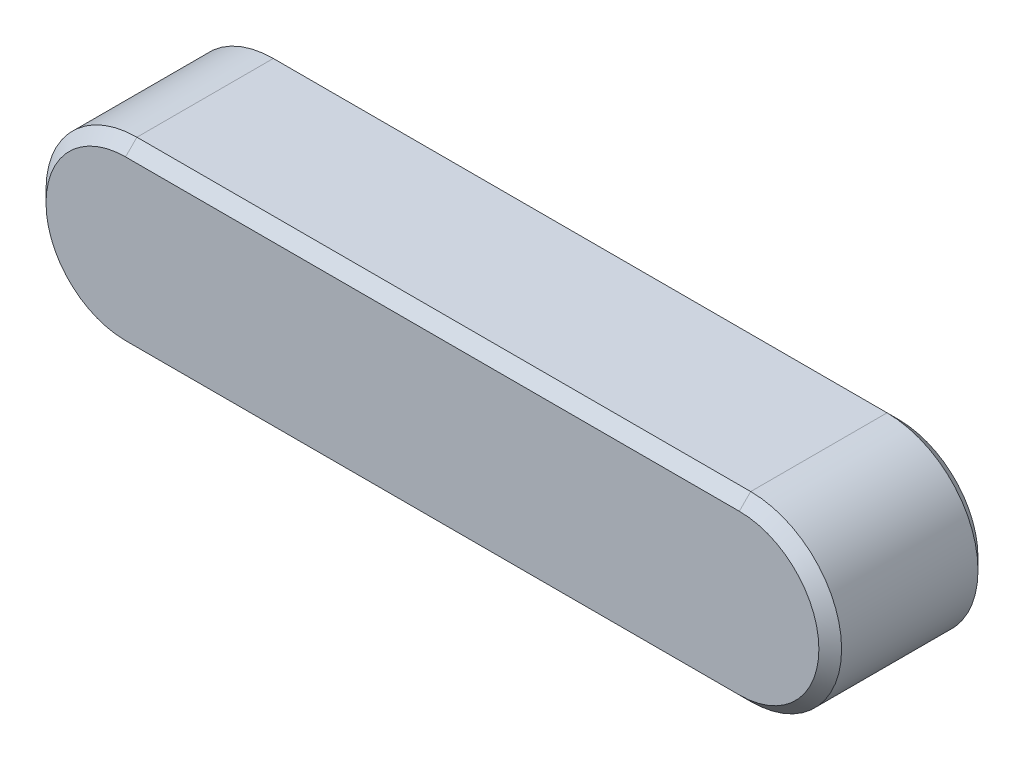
ISO-10303-21;
HEADER;
FILE_DESCRIPTION(('STEP AP214'),'2;1');
FILE_NAME('part.step','',(''),(''),'','','');
FILE_SCHEMA(('AUTOMOTIVE_DESIGN { 1 0 10303 214 1 1 1 1 }'));
ENDSEC;
DATA;
#1=APPLICATION_CONTEXT('core data for automotive mechanical design processes');
#2=APPLICATION_PROTOCOL_DEFINITION('international standard','automotive_design',2000,#1);
#3=PRODUCT_CONTEXT('',#1,'mechanical');
#4=PRODUCT('Part','Part','',(#3));
#5=PRODUCT_RELATED_PRODUCT_CATEGORY('part','',(#4));
#6=PRODUCT_DEFINITION_FORMATION('','',#4);
#7=PRODUCT_DEFINITION_CONTEXT('part definition',#1,'design');
#8=PRODUCT_DEFINITION('design','',#6,#7);
#9=PRODUCT_DEFINITION_SHAPE('','',#8);
#10=(LENGTH_UNIT() NAMED_UNIT(*) SI_UNIT(.MILLI.,.METRE.));
#11=(NAMED_UNIT(*) PLANE_ANGLE_UNIT() SI_UNIT($,.RADIAN.));
#12=(NAMED_UNIT(*) SI_UNIT($,.STERADIAN.) SOLID_ANGLE_UNIT());
#13=UNCERTAINTY_MEASURE_WITH_UNIT(LENGTH_MEASURE(1.E-05),#10,'distance_accuracy_value','');
#14=(GEOMETRIC_REPRESENTATION_CONTEXT(3) GLOBAL_UNCERTAINTY_ASSIGNED_CONTEXT((#13)) GLOBAL_UNIT_ASSIGNED_CONTEXT((#10,
#11,#12)) REPRESENTATION_CONTEXT('',''));
#15=CARTESIAN_POINT('',(0.,0.,0.));
#16=DIRECTION('',(0.,0.,1.));
#17=DIRECTION('',(1.,0.,0.));
#18=AXIS2_PLACEMENT_3D('',#15,#16,#17);
#19=CARTESIAN_POINT('',(-13.5,0.,3.5));
#20=DIRECTION('',(0.,0.,-1.));
#21=DIRECTION('',(-1.,0.,0.));
#22=AXIS2_PLACEMENT_3D('',#19,#20,#21);
#23=CYLINDRICAL_SURFACE('',#22,4.);
#24=DIRECTION('',(0.,0.,-1.));
#25=VECTOR('',#24,1.);
#26=CARTESIAN_POINT('',(-13.5,4.,3.5));
#27=LINE('',#26,#25);
#28=CARTESIAN_POINT('',(-13.5,4.,2.99999999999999));
#29=VERTEX_POINT('',#28);
#30=CARTESIAN_POINT('',(-13.5,4.00000000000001,-3.));
#31=VERTEX_POINT('',#30);
#32=EDGE_CURVE('E143',#29,#31,#27,.T.);
#33=ORIENTED_EDGE('',*,*,#32,.T.);
#34=CARTESIAN_POINT('',(-13.5,0.,-2.99999999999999));
#35=DIRECTION('',(0.,0.,1.));
#36=DIRECTION('',(1.,0.,0.));
#37=AXIS2_PLACEMENT_3D('',#34,#35,#36);
#38=CIRCLE('',#37,4.);
#39=CARTESIAN_POINT('',(-13.5,-3.99999999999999,-2.99999999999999));
#40=VERTEX_POINT('',#39);
#41=EDGE_CURVE('E100',#31,#40,#38,.T.);
#42=ORIENTED_EDGE('',*,*,#41,.T.);
#43=DIRECTION('',(0.,0.,-1.));
#44=VECTOR('',#43,1.);
#45=CARTESIAN_POINT('',(-13.5,-4.,3.5));
#46=LINE('',#45,#44);
#47=CARTESIAN_POINT('',(-13.5,-4.,3.));
#48=VERTEX_POINT('',#47);
#49=EDGE_CURVE('E111',#48,#40,#46,.T.);
#50=ORIENTED_EDGE('',*,*,#49,.F.);
#51=CARTESIAN_POINT('',(-13.5,0.,3.));
#52=DIRECTION('',(0.,0.,1.));
#53=DIRECTION('',(1.,0.,0.));
#54=AXIS2_PLACEMENT_3D('',#51,#52,#53);
#55=CIRCLE('',#54,4.);
#56=EDGE_CURVE('E165',#48,#29,#55,.F.);
#57=ORIENTED_EDGE('',*,*,#56,.T.);
#58=EDGE_LOOP('',(#33,#42,#50,#57));
#59=FACE_BOUND('',#58,.T.);
#60=ADVANCED_FACE('F28',(#59),#23,.T.);
#61=CARTESIAN_POINT('',(-13.5,-4.,3.5));
#62=DIRECTION('',(0.,1.,0.));
#63=DIRECTION('',(-1.,0.,0.));
#64=AXIS2_PLACEMENT_3D('',#61,#62,#63);
#65=PLANE('',#64);
#66=ORIENTED_EDGE('',*,*,#49,.T.);
#67=DIRECTION('',(1.,0.,0.));
#68=VECTOR('',#67,1.);
#69=CARTESIAN_POINT('',(-13.5,-3.99999999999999,-2.99999999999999));
#70=LINE('',#69,#68);
#71=CARTESIAN_POINT('',(13.5,-4.,-2.99999999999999));
#72=VERTEX_POINT('',#71);
#73=EDGE_CURVE('E110',#40,#72,#70,.T.);
#74=ORIENTED_EDGE('',*,*,#73,.T.);
#75=DIRECTION('',(0.,0.,-1.));
#76=VECTOR('',#75,1.);
#77=CARTESIAN_POINT('',(13.5,-4.,3.5));
#78=LINE('',#77,#76);
#79=CARTESIAN_POINT('',(13.5,-4.,3.));
#80=VERTEX_POINT('',#79);
#81=EDGE_CURVE('E94',#80,#72,#78,.T.);
#82=ORIENTED_EDGE('',*,*,#81,.F.);
#83=DIRECTION('',(-1.,0.,0.));
#84=VECTOR('',#83,1.);
#85=CARTESIAN_POINT('',(-13.5,-4.,3.));
#86=LINE('',#85,#84);
#87=EDGE_CURVE('E107',#80,#48,#86,.T.);
#88=ORIENTED_EDGE('',*,*,#87,.T.);
#89=EDGE_LOOP('',(#66,#74,#82,#88));
#90=FACE_BOUND('',#89,.T.);
#91=ADVANCED_FACE('F30',(#90),#65,.F.);
#92=CARTESIAN_POINT('',(13.5,0.,3.5));
#93=DIRECTION('',(0.,0.,-1.));
#94=DIRECTION('',(-1.,0.,0.));
#95=AXIS2_PLACEMENT_3D('',#92,#93,#94);
#96=CYLINDRICAL_SURFACE('',#95,4.);
#97=ORIENTED_EDGE('',*,*,#81,.T.);
#98=CARTESIAN_POINT('',(13.5,0.,-2.99999999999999));
#99=DIRECTION('',(0.,0.,1.));
#100=DIRECTION('',(1.,0.,0.));
#101=AXIS2_PLACEMENT_3D('',#98,#99,#100);
#102=CIRCLE('',#101,4.);
#103=CARTESIAN_POINT('',(13.5,4.,-3.));
#104=VERTEX_POINT('',#103);
#105=EDGE_CURVE('E43',#72,#104,#102,.T.);
#106=ORIENTED_EDGE('',*,*,#105,.T.);
#107=DIRECTION('',(0.,0.,-1.));
#108=VECTOR('',#107,1.);
#109=CARTESIAN_POINT('',(13.5,4.,3.5));
#110=LINE('',#109,#108);
#111=CARTESIAN_POINT('',(13.5,4.,2.99999999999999));
#112=VERTEX_POINT('',#111);
#113=EDGE_CURVE('E95',#112,#104,#110,.T.);
#114=ORIENTED_EDGE('',*,*,#113,.F.);
#115=CARTESIAN_POINT('',(13.5,0.,3.));
#116=DIRECTION('',(0.,0.,1.));
#117=DIRECTION('',(1.,0.,0.));
#118=AXIS2_PLACEMENT_3D('',#115,#116,#117);
#119=CIRCLE('',#118,4.);
#120=EDGE_CURVE('E91',#112,#80,#119,.F.);
#121=ORIENTED_EDGE('',*,*,#120,.T.);
#122=EDGE_LOOP('',(#97,#106,#114,#121));
#123=FACE_BOUND('',#122,.T.);
#124=ADVANCED_FACE('F93',(#123),#96,.T.);
#125=CARTESIAN_POINT('',(-13.5,4.,3.5));
#126=DIRECTION('',(0.,1.,0.));
#127=DIRECTION('',(-1.,0.,0.));
#128=AXIS2_PLACEMENT_3D('',#125,#126,#127);
#129=PLANE('',#128);
#130=ORIENTED_EDGE('',*,*,#113,.T.);
#131=DIRECTION('',(-1.,0.,0.));
#132=VECTOR('',#131,1.);
#133=CARTESIAN_POINT('',(-13.5,4.00000000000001,-3.));
#134=LINE('',#133,#132);
#135=EDGE_CURVE('E11',#104,#31,#134,.T.);
#136=ORIENTED_EDGE('',*,*,#135,.T.);
#137=ORIENTED_EDGE('',*,*,#32,.F.);
#138=DIRECTION('',(1.,0.,0.));
#139=VECTOR('',#138,1.);
#140=CARTESIAN_POINT('',(-13.5,4.,2.99999999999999));
#141=LINE('',#140,#139);
#142=EDGE_CURVE('E36',#29,#112,#141,.T.);
#143=ORIENTED_EDGE('',*,*,#142,.T.);
#144=EDGE_LOOP('',(#130,#136,#137,#143));
#145=FACE_BOUND('',#144,.T.);
#146=ADVANCED_FACE('F187',(#145),#129,.T.);
#147=CARTESIAN_POINT('',(-13.5,0.,3.5));
#148=DIRECTION('',(0.,0.,1.));
#149=DIRECTION('',(1.,0.,0.));
#150=AXIS2_PLACEMENT_3D('',#147,#148,#149);
#151=PLANE('',#150);
#152=CARTESIAN_POINT('',(-13.5,0.,3.5));
#153=DIRECTION('',(0.,0.,1.));
#154=DIRECTION('',(1.,0.,0.));
#155=AXIS2_PLACEMENT_3D('',#152,#153,#154);
#156=CIRCLE('',#155,3.49999999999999);
#157=CARTESIAN_POINT('',(-13.5,3.5,3.5));
#158=VERTEX_POINT('',#157);
#159=CARTESIAN_POINT('',(-13.5,-3.49999999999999,3.5));
#160=VERTEX_POINT('',#159);
#161=EDGE_CURVE('E161',#158,#160,#156,.T.);
#162=ORIENTED_EDGE('',*,*,#161,.T.);
#163=DIRECTION('',(1.,0.,0.));
#164=VECTOR('',#163,1.);
#165=CARTESIAN_POINT('',(13.5,-3.49999999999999,3.5));
#166=LINE('',#165,#164);
#167=CARTESIAN_POINT('',(13.5,-3.49999999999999,3.5));
#168=VERTEX_POINT('',#167);
#169=EDGE_CURVE('E163',#160,#168,#166,.T.);
#170=ORIENTED_EDGE('',*,*,#169,.T.);
#171=CARTESIAN_POINT('',(13.5,0.,3.5));
#172=DIRECTION('',(0.,0.,1.));
#173=DIRECTION('',(1.,0.,0.));
#174=AXIS2_PLACEMENT_3D('',#171,#172,#173);
#175=CIRCLE('',#174,3.49999999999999);
#176=CARTESIAN_POINT('',(13.5,3.5,3.5));
#177=VERTEX_POINT('',#176);
#178=EDGE_CURVE('E123',#168,#177,#175,.T.);
#179=ORIENTED_EDGE('',*,*,#178,.T.);
#180=DIRECTION('',(-1.,0.,0.));
#181=VECTOR('',#180,1.);
#182=CARTESIAN_POINT('',(-13.5,3.5,3.5));
#183=LINE('',#182,#181);
#184=EDGE_CURVE('E158',#177,#158,#183,.T.);
#185=ORIENTED_EDGE('',*,*,#184,.T.);
#186=EDGE_LOOP('',(#162,#170,#179,#185));
#187=FACE_BOUND('',#186,.T.);
#188=ADVANCED_FACE('F196',(#187),#151,.T.);
#189=CARTESIAN_POINT('',(-13.5,0.,-3.5));
#190=DIRECTION('',(0.,0.,1.));
#191=DIRECTION('',(1.,0.,0.));
#192=AXIS2_PLACEMENT_3D('',#189,#190,#191);
#193=PLANE('',#192);
#194=CARTESIAN_POINT('',(13.5,0.,-3.5));
#195=DIRECTION('',(0.,0.,1.));
#196=DIRECTION('',(1.,0.,0.));
#197=AXIS2_PLACEMENT_3D('',#194,#195,#196);
#198=CIRCLE('',#197,3.5);
#199=CARTESIAN_POINT('',(13.5,3.49999999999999,-3.5));
#200=VERTEX_POINT('',#199);
#201=CARTESIAN_POINT('',(13.5,-3.5,-3.5));
#202=VERTEX_POINT('',#201);
#203=EDGE_CURVE('E151',#200,#202,#198,.F.);
#204=ORIENTED_EDGE('',*,*,#203,.T.);
#205=DIRECTION('',(-1.,0.,0.));
#206=VECTOR('',#205,1.);
#207=CARTESIAN_POINT('',(-13.5,-3.49999999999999,-3.5));
#208=LINE('',#207,#206);
#209=CARTESIAN_POINT('',(-13.5,-3.49999999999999,-3.5));
#210=VERTEX_POINT('',#209);
#211=EDGE_CURVE('E155',#202,#210,#208,.T.);
#212=ORIENTED_EDGE('',*,*,#211,.T.);
#213=CARTESIAN_POINT('',(-13.5,0.,-3.5));
#214=DIRECTION('',(0.,0.,1.));
#215=DIRECTION('',(1.,0.,0.));
#216=AXIS2_PLACEMENT_3D('',#213,#214,#215);
#217=CIRCLE('',#216,3.5);
#218=CARTESIAN_POINT('',(-13.5,3.5,-3.5));
#219=VERTEX_POINT('',#218);
#220=EDGE_CURVE('E153',#210,#219,#217,.F.);
#221=ORIENTED_EDGE('',*,*,#220,.T.);
#222=DIRECTION('',(1.,0.,0.));
#223=VECTOR('',#222,1.);
#224=CARTESIAN_POINT('',(13.5,3.49999999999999,-3.5));
#225=LINE('',#224,#223);
#226=EDGE_CURVE('E149',#219,#200,#225,.T.);
#227=ORIENTED_EDGE('',*,*,#226,.T.);
#228=EDGE_LOOP('',(#204,#212,#221,#227));
#229=FACE_BOUND('',#228,.T.);
#230=ADVANCED_FACE('F198',(#229),#193,.F.);
#231=CARTESIAN_POINT('',(-13.5,3.5,-3.5));
#232=DIRECTION('',(0.,0.707106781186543,-0.707106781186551));
#233=DIRECTION('',(0.,0.707106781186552,0.707106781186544));
#234=AXIS2_PLACEMENT_3D('',#231,#232,#233);
#235=PLANE('',#234);
#236=DIRECTION('',(0.,0.707106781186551,0.707106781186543));
#237=VECTOR('',#236,1.);
#238=CARTESIAN_POINT('',(13.5,3.49999999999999,-3.5));
#239=LINE('',#238,#237);
#240=EDGE_CURVE('E137',#200,#104,#239,.T.);
#241=ORIENTED_EDGE('',*,*,#240,.F.);
#242=ORIENTED_EDGE('',*,*,#226,.F.);
#243=DIRECTION('',(0.,-0.707106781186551,-0.707106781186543));
#244=VECTOR('',#243,1.);
#245=CARTESIAN_POINT('',(-13.5,4.00000000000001,-3.));
#246=LINE('',#245,#244);
#247=EDGE_CURVE('E140',#31,#219,#246,.T.);
#248=ORIENTED_EDGE('',*,*,#247,.F.);
#249=ORIENTED_EDGE('',*,*,#135,.F.);
#250=EDGE_LOOP('',(#241,#242,#248,#249));
#251=FACE_BOUND('',#250,.T.);
#252=ADVANCED_FACE('F186',(#251),#235,.T.);
#253=CARTESIAN_POINT('',(-13.5,0.,-2.99999999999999));
#254=DIRECTION('',(0.,0.,1.));
#255=DIRECTION('',(1.,0.,0.));
#256=AXIS2_PLACEMENT_3D('',#253,#254,#255);
#257=CONICAL_SURFACE('',#256,4.,0.785398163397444);
#258=ORIENTED_EDGE('',*,*,#247,.T.);
#259=ORIENTED_EDGE('',*,*,#220,.F.);
#260=DIRECTION('',(0.,0.707106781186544,-0.707106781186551));
#261=VECTOR('',#260,1.);
#262=CARTESIAN_POINT('',(-13.5,-3.99999999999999,-2.99999999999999));
#263=LINE('',#262,#261);
#264=EDGE_CURVE('E135',#40,#210,#263,.T.);
#265=ORIENTED_EDGE('',*,*,#264,.F.);
#266=ORIENTED_EDGE('',*,*,#41,.F.);
#267=EDGE_LOOP('',(#258,#259,#265,#266));
#268=FACE_BOUND('',#267,.T.);
#269=ADVANCED_FACE('F174',(#268),#257,.T.);
#270=CARTESIAN_POINT('',(13.5,0.,-2.99999999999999));
#271=DIRECTION('',(0.,0.,1.));
#272=DIRECTION('',(1.,0.,0.));
#273=AXIS2_PLACEMENT_3D('',#270,#271,#272);
#274=CONICAL_SURFACE('',#273,4.,0.785398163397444);
#275=ORIENTED_EDGE('',*,*,#240,.T.);
#276=ORIENTED_EDGE('',*,*,#105,.F.);
#277=DIRECTION('',(0.,-0.707106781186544,0.707106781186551));
#278=VECTOR('',#277,1.);
#279=CARTESIAN_POINT('',(13.5,-3.5,-3.5));
#280=LINE('',#279,#278);
#281=EDGE_CURVE('E133',#202,#72,#280,.T.);
#282=ORIENTED_EDGE('',*,*,#281,.F.);
#283=ORIENTED_EDGE('',*,*,#203,.F.);
#284=EDGE_LOOP('',(#275,#276,#282,#283));
#285=FACE_BOUND('',#284,.T.);
#286=ADVANCED_FACE('F181',(#285),#274,.T.);
#287=CARTESIAN_POINT('',(-13.5,-3.99999999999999,-2.99999999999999));
#288=DIRECTION('',(0.,0.707106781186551,0.707106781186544));
#289=DIRECTION('',(0.,-0.707106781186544,0.707106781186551));
#290=AXIS2_PLACEMENT_3D('',#287,#288,#289);
#291=PLANE('',#290);
#292=ORIENTED_EDGE('',*,*,#264,.T.);
#293=ORIENTED_EDGE('',*,*,#211,.F.);
#294=ORIENTED_EDGE('',*,*,#281,.T.);
#295=ORIENTED_EDGE('',*,*,#73,.F.);
#296=EDGE_LOOP('',(#292,#293,#294,#295));
#297=FACE_BOUND('',#296,.T.);
#298=ADVANCED_FACE('F177',(#297),#291,.F.);
#299=CARTESIAN_POINT('',(-13.5,4.,2.99999999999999));
#300=DIRECTION('',(0.,-0.707106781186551,-0.707106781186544));
#301=DIRECTION('',(0.,0.707106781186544,-0.707106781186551));
#302=AXIS2_PLACEMENT_3D('',#299,#300,#301);
#303=PLANE('',#302);
#304=DIRECTION('',(0.,-0.707106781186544,0.707106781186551));
#305=VECTOR('',#304,1.);
#306=CARTESIAN_POINT('',(13.5,4.,2.99999999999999));
#307=LINE('',#306,#305);
#308=EDGE_CURVE('E126',#112,#177,#307,.T.);
#309=ORIENTED_EDGE('',*,*,#308,.F.);
#310=ORIENTED_EDGE('',*,*,#142,.F.);
#311=DIRECTION('',(0.,0.707106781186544,-0.707106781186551));
#312=VECTOR('',#311,1.);
#313=CARTESIAN_POINT('',(-13.5,3.5,3.5));
#314=LINE('',#313,#312);
#315=EDGE_CURVE('E130',#158,#29,#314,.T.);
#316=ORIENTED_EDGE('',*,*,#315,.F.);
#317=ORIENTED_EDGE('',*,*,#184,.F.);
#318=EDGE_LOOP('',(#309,#310,#316,#317));
#319=FACE_BOUND('',#318,.T.);
#320=ADVANCED_FACE('F190',(#319),#303,.F.);
#321=CARTESIAN_POINT('',(-13.5,0.,3.5));
#322=DIRECTION('',(0.,0.,-1.));
#323=DIRECTION('',(-1.,0.,0.));
#324=AXIS2_PLACEMENT_3D('',#321,#322,#323);
#325=CONICAL_SURFACE('',#324,3.49999999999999,0.785398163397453);
#326=ORIENTED_EDGE('',*,*,#315,.T.);
#327=ORIENTED_EDGE('',*,*,#56,.F.);
#328=DIRECTION('',(0.,-0.707106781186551,-0.707106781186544));
#329=VECTOR('',#328,1.);
#330=CARTESIAN_POINT('',(-13.5,-3.49999999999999,3.5));
#331=LINE('',#330,#329);
#332=EDGE_CURVE('E119',#160,#48,#331,.T.);
#333=ORIENTED_EDGE('',*,*,#332,.F.);
#334=ORIENTED_EDGE('',*,*,#161,.F.);
#335=EDGE_LOOP('',(#326,#327,#333,#334));
#336=FACE_BOUND('',#335,.T.);
#337=ADVANCED_FACE('F194',(#336),#325,.T.);
#338=CARTESIAN_POINT('',(13.5,0.,3.5));
#339=DIRECTION('',(0.,0.,-1.));
#340=DIRECTION('',(-1.,0.,0.));
#341=AXIS2_PLACEMENT_3D('',#338,#339,#340);
#342=CONICAL_SURFACE('',#341,3.49999999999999,0.785398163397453);
#343=ORIENTED_EDGE('',*,*,#308,.T.);
#344=ORIENTED_EDGE('',*,*,#178,.F.);
#345=DIRECTION('',(0.,0.707106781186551,0.707106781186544));
#346=VECTOR('',#345,1.);
#347=CARTESIAN_POINT('',(13.5,-4.,3.));
#348=LINE('',#347,#346);
#349=EDGE_CURVE('E116',#80,#168,#348,.T.);
#350=ORIENTED_EDGE('',*,*,#349,.F.);
#351=ORIENTED_EDGE('',*,*,#120,.F.);
#352=EDGE_LOOP('',(#343,#344,#350,#351));
#353=FACE_BOUND('',#352,.T.);
#354=ADVANCED_FACE('F122',(#353),#342,.T.);
#355=CARTESIAN_POINT('',(-13.5,-3.49999999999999,3.5));
#356=DIRECTION('',(0.,-0.707106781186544,0.707106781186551));
#357=DIRECTION('',(0.,-0.707106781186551,-0.707106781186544));
#358=AXIS2_PLACEMENT_3D('',#355,#356,#357);
#359=PLANE('',#358);
#360=ORIENTED_EDGE('',*,*,#332,.T.);
#361=ORIENTED_EDGE('',*,*,#87,.F.);
#362=ORIENTED_EDGE('',*,*,#349,.T.);
#363=ORIENTED_EDGE('',*,*,#169,.F.);
#364=EDGE_LOOP('',(#360,#361,#362,#363));
#365=FACE_BOUND('',#364,.T.);
#366=ADVANCED_FACE('F114',(#365),#359,.T.);
#367=CLOSED_SHELL('',(#60,#91,#124,#146,#188,#230,#252,#269,#286,#298,#320,#337,#354,#366));
#368=MANIFOLD_SOLID_BREP('B2',#367);
#369=ADVANCED_BREP_SHAPE_REPRESENTATION('',(#18,#368),#14);
#370=SHAPE_DEFINITION_REPRESENTATION(#9,#369);
ENDSEC;
END-ISO-10303-21;
